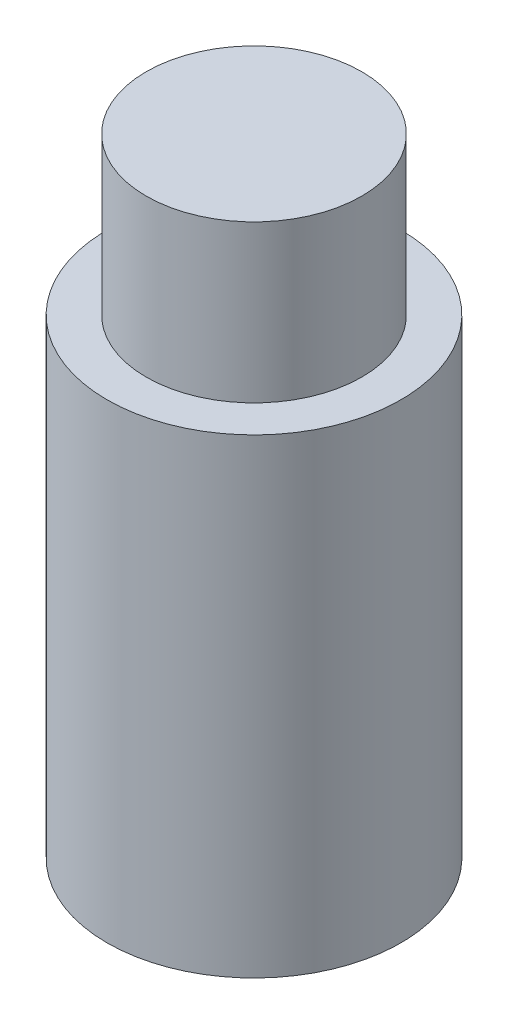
ISO-10303-21;
HEADER;
FILE_DESCRIPTION(('STEP AP214'),'2;1');
FILE_NAME('part.step','',(''),(''),'','','');
FILE_SCHEMA(('AUTOMOTIVE_DESIGN { 1 0 10303 214 1 1 1 1 }'));
ENDSEC;
DATA;
#1=APPLICATION_CONTEXT('core data for automotive mechanical design processes');
#2=APPLICATION_PROTOCOL_DEFINITION('international standard','automotive_design',2000,#1);
#3=PRODUCT_CONTEXT('',#1,'mechanical');
#4=PRODUCT('Part','Part','',(#3));
#5=PRODUCT_RELATED_PRODUCT_CATEGORY('part','',(#4));
#6=PRODUCT_DEFINITION_FORMATION('','',#4);
#7=PRODUCT_DEFINITION_CONTEXT('part definition',#1,'design');
#8=PRODUCT_DEFINITION('design','',#6,#7);
#9=PRODUCT_DEFINITION_SHAPE('','',#8);
#10=(LENGTH_UNIT() NAMED_UNIT(*) SI_UNIT(.MILLI.,.METRE.));
#11=(NAMED_UNIT(*) PLANE_ANGLE_UNIT() SI_UNIT($,.RADIAN.));
#12=(NAMED_UNIT(*) SI_UNIT($,.STERADIAN.) SOLID_ANGLE_UNIT());
#13=UNCERTAINTY_MEASURE_WITH_UNIT(LENGTH_MEASURE(1.E-05),#10,'distance_accuracy_value','');
#14=(GEOMETRIC_REPRESENTATION_CONTEXT(3) GLOBAL_UNCERTAINTY_ASSIGNED_CONTEXT((#13)) GLOBAL_UNIT_ASSIGNED_CONTEXT((#10,
#11,#12)) REPRESENTATION_CONTEXT('',''));
#15=CARTESIAN_POINT('',(0.,0.,0.));
#16=DIRECTION('',(0.,0.,1.));
#17=DIRECTION('',(1.,0.,0.));
#18=AXIS2_PLACEMENT_3D('',#15,#16,#17);
#19=CARTESIAN_POINT('',(0.,16.,0.));
#20=DIRECTION('',(0.,1.,0.));
#21=DIRECTION('',(0.,0.,1.));
#22=AXIS2_PLACEMENT_3D('',#19,#20,#21);
#23=PLANE('',#22);
#24=CARTESIAN_POINT('',(0.,16.,0.));
#25=DIRECTION('',(0.,1.,0.));
#26=DIRECTION('',(0.,0.,1.));
#27=AXIS2_PLACEMENT_3D('',#24,#25,#26);
#28=CIRCLE('',#27,2.75);
#29=CARTESIAN_POINT('',(0.,16.,2.75));
#30=VERTEX_POINT('',#29);
#31=EDGE_CURVE('E10',#30,#30,#28,.T.);
#32=ORIENTED_EDGE('',*,*,#31,.T.);
#33=EDGE_LOOP('',(#32));
#34=FACE_BOUND('',#33,.T.);
#35=ADVANCED_FACE('F32',(#34),#23,.T.);
#36=CARTESIAN_POINT('',(0.,16.,0.));
#37=DIRECTION('',(0.,1.,0.));
#38=DIRECTION('',(0.,0.,1.));
#39=AXIS2_PLACEMENT_3D('',#36,#37,#38);
#40=CYLINDRICAL_SURFACE('',#39,2.75);
#41=CARTESIAN_POINT('',(0.,12.,0.));
#42=DIRECTION('',(0.,1.,0.));
#43=DIRECTION('',(0.,0.,1.));
#44=AXIS2_PLACEMENT_3D('',#41,#42,#43);
#45=CIRCLE('',#44,2.75);
#46=CARTESIAN_POINT('',(0.,12.,2.75));
#47=VERTEX_POINT('',#46);
#48=EDGE_CURVE('E38',#47,#47,#45,.T.);
#49=ORIENTED_EDGE('',*,*,#48,.T.);
#50=EDGE_LOOP('',(#49));
#51=FACE_BOUND('',#50,.T.);
#52=ORIENTED_EDGE('',*,*,#31,.F.);
#53=EDGE_LOOP('',(#52));
#54=FACE_BOUND('',#53,.T.);
#55=ADVANCED_FACE('F70',(#51,#54),#40,.T.);
#56=CARTESIAN_POINT('',(0.,12.,2.75));
#57=DIRECTION('',(0.,1.,0.));
#58=DIRECTION('',(0.,0.,1.));
#59=AXIS2_PLACEMENT_3D('',#56,#57,#58);
#60=PLANE('',#59);
#61=CARTESIAN_POINT('',(0.,12.,0.));
#62=DIRECTION('',(0.,1.,0.));
#63=DIRECTION('',(0.,0.,1.));
#64=AXIS2_PLACEMENT_3D('',#61,#62,#63);
#65=CIRCLE('',#64,3.75);
#66=CARTESIAN_POINT('',(0.,12.,3.75));
#67=VERTEX_POINT('',#66);
#68=EDGE_CURVE('E42',#67,#67,#65,.T.);
#69=ORIENTED_EDGE('',*,*,#68,.T.);
#70=EDGE_LOOP('',(#69));
#71=FACE_BOUND('',#70,.T.);
#72=ORIENTED_EDGE('',*,*,#48,.F.);
#73=EDGE_LOOP('',(#72));
#74=FACE_BOUND('',#73,.T.);
#75=ADVANCED_FACE('F74',(#71,#74),#60,.T.);
#76=CARTESIAN_POINT('',(0.,16.,0.));
#77=DIRECTION('',(0.,1.,0.));
#78=DIRECTION('',(0.,0.,1.));
#79=AXIS2_PLACEMENT_3D('',#76,#77,#78);
#80=CYLINDRICAL_SURFACE('',#79,3.75);
#81=CARTESIAN_POINT('',(0.,0.,0.));
#82=DIRECTION('',(0.,1.,0.));
#83=DIRECTION('',(0.,0.,1.));
#84=AXIS2_PLACEMENT_3D('',#81,#82,#83);
#85=CIRCLE('',#84,3.75);
#86=CARTESIAN_POINT('',(0.,0.,3.75));
#87=VERTEX_POINT('',#86);
#88=EDGE_CURVE('E46',#87,#87,#85,.T.);
#89=ORIENTED_EDGE('',*,*,#88,.T.);
#90=EDGE_LOOP('',(#89));
#91=FACE_BOUND('',#90,.T.);
#92=ORIENTED_EDGE('',*,*,#68,.F.);
#93=EDGE_LOOP('',(#92));
#94=FACE_BOUND('',#93,.T.);
#95=ADVANCED_FACE('F78',(#91,#94),#80,.T.);
#96=CARTESIAN_POINT('',(0.,0.,3.75));
#97=DIRECTION('',(0.,-1.,0.));
#98=DIRECTION('',(0.,0.,-1.));
#99=AXIS2_PLACEMENT_3D('',#96,#97,#98);
#100=PLANE('',#99);
#101=CARTESIAN_POINT('',(0.,0.,0.));
#102=DIRECTION('',(0.,1.,0.));
#103=DIRECTION('',(0.,0.,1.));
#104=AXIS2_PLACEMENT_3D('',#101,#102,#103);
#105=CIRCLE('',#104,1.75);
#106=CARTESIAN_POINT('',(0.,0.,1.75));
#107=VERTEX_POINT('',#106);
#108=EDGE_CURVE('E51',#107,#107,#105,.T.);
#109=ORIENTED_EDGE('',*,*,#108,.T.);
#110=EDGE_LOOP('',(#109));
#111=FACE_BOUND('',#110,.T.);
#112=ORIENTED_EDGE('',*,*,#88,.F.);
#113=EDGE_LOOP('',(#112));
#114=FACE_BOUND('',#113,.T.);
#115=ADVANCED_FACE('F67',(#111,#114),#100,.T.);
#116=CARTESIAN_POINT('',(0.,16.,0.));
#117=DIRECTION('',(0.,1.,0.));
#118=DIRECTION('',(0.,0.,1.));
#119=AXIS2_PLACEMENT_3D('',#116,#117,#118);
#120=CYLINDRICAL_SURFACE('',#119,1.75);
#121=CARTESIAN_POINT('',(0.,3.,0.));
#122=DIRECTION('',(0.,1.,0.));
#123=DIRECTION('',(0.,0.,1.));
#124=AXIS2_PLACEMENT_3D('',#121,#122,#123);
#125=CIRCLE('',#124,1.75);
#126=CARTESIAN_POINT('',(0.,3.,1.75));
#127=VERTEX_POINT('',#126);
#128=EDGE_CURVE('E54',#127,#127,#125,.T.);
#129=ORIENTED_EDGE('',*,*,#128,.T.);
#130=EDGE_LOOP('',(#129));
#131=FACE_BOUND('',#130,.T.);
#132=ORIENTED_EDGE('',*,*,#108,.F.);
#133=EDGE_LOOP('',(#132));
#134=FACE_BOUND('',#133,.T.);
#135=ADVANCED_FACE('F58',(#131,#134),#120,.F.);
#136=CARTESIAN_POINT('',(0.,3.,1.75));
#137=DIRECTION('',(0.,-1.,0.));
#138=DIRECTION('',(0.,0.,-1.));
#139=AXIS2_PLACEMENT_3D('',#136,#137,#138);
#140=PLANE('',#139);
#141=ORIENTED_EDGE('',*,*,#128,.F.);
#142=EDGE_LOOP('',(#141));
#143=FACE_BOUND('',#142,.T.);
#144=ADVANCED_FACE('F61',(#143),#140,.T.);
#145=CLOSED_SHELL('',(#35,#55,#75,#95,#115,#135,#144));
#146=MANIFOLD_SOLID_BREP('B2',#145);
#147=ADVANCED_BREP_SHAPE_REPRESENTATION('',(#18,#146),#14);
#148=SHAPE_DEFINITION_REPRESENTATION(#9,#147);
ENDSEC;
END-ISO-10303-21;
